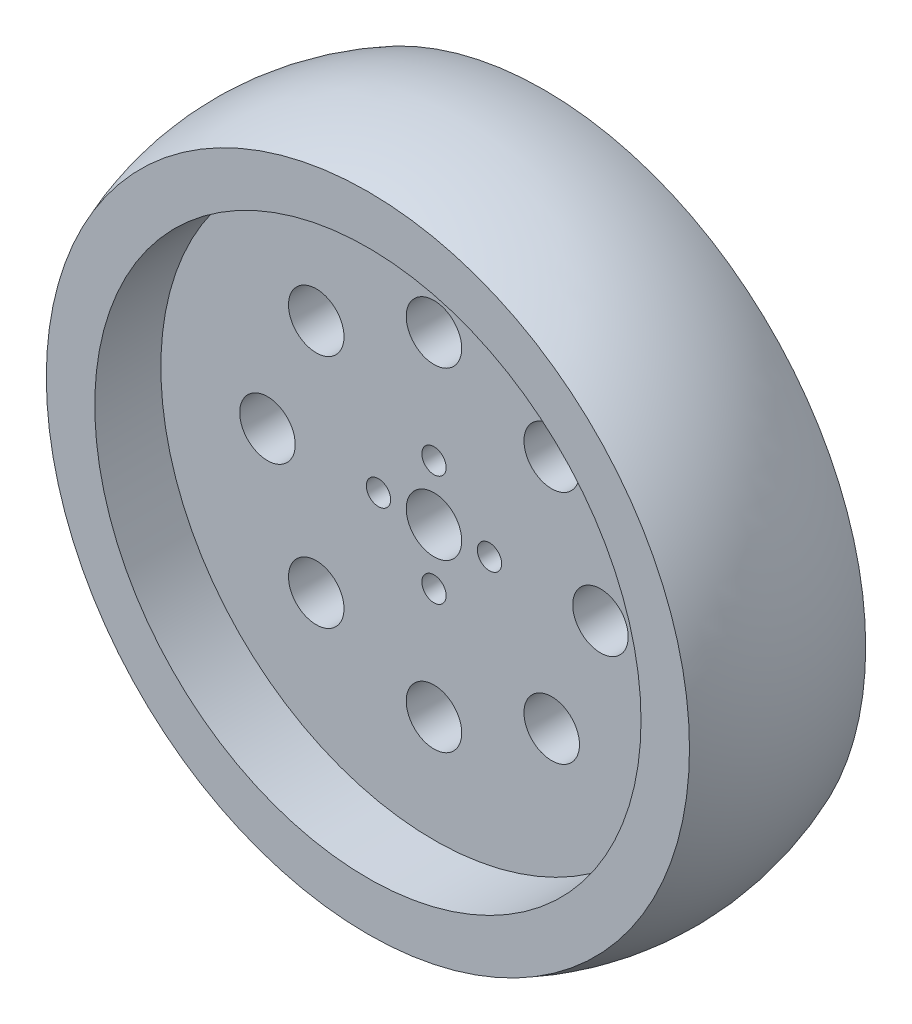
ISO-10303-21;
HEADER;
FILE_DESCRIPTION(('STEP AP214'),'2;1');
FILE_NAME('part.step','',(''),(''),'','','');
FILE_SCHEMA(('AUTOMOTIVE_DESIGN { 1 0 10303 214 1 1 1 1 }'));
ENDSEC;
DATA;
#1=APPLICATION_CONTEXT('core data for automotive mechanical design processes');
#2=APPLICATION_PROTOCOL_DEFINITION('international standard','automotive_design',2000,#1);
#3=PRODUCT_CONTEXT('',#1,'mechanical');
#4=PRODUCT('Part','Part','',(#3));
#5=PRODUCT_RELATED_PRODUCT_CATEGORY('part','',(#4));
#6=PRODUCT_DEFINITION_FORMATION('','',#4);
#7=PRODUCT_DEFINITION_CONTEXT('part definition',#1,'design');
#8=PRODUCT_DEFINITION('design','',#6,#7);
#9=PRODUCT_DEFINITION_SHAPE('','',#8);
#10=(LENGTH_UNIT() NAMED_UNIT(*) SI_UNIT(.MILLI.,.METRE.));
#11=(NAMED_UNIT(*) PLANE_ANGLE_UNIT() SI_UNIT($,.RADIAN.));
#12=(NAMED_UNIT(*) SI_UNIT($,.STERADIAN.) SOLID_ANGLE_UNIT());
#13=UNCERTAINTY_MEASURE_WITH_UNIT(LENGTH_MEASURE(1.E-05),#10,'distance_accuracy_value','');
#14=(GEOMETRIC_REPRESENTATION_CONTEXT(3) GLOBAL_UNCERTAINTY_ASSIGNED_CONTEXT((#13)) GLOBAL_UNIT_ASSIGNED_CONTEXT((#10,
#11,#12)) REPRESENTATION_CONTEXT('',''));
#15=CARTESIAN_POINT('',(0.,0.,0.));
#16=DIRECTION('',(0.,0.,1.));
#17=DIRECTION('',(1.,0.,0.));
#18=AXIS2_PLACEMENT_3D('',#15,#16,#17);
#19=CARTESIAN_POINT('',(0.,0.,2.159));
#20=DIRECTION('',(0.,0.,1.));
#21=DIRECTION('',(1.,0.,0.));
#22=AXIS2_PLACEMENT_3D('',#19,#20,#21);
#23=PLANE('',#22);
#24=CARTESIAN_POINT('',(0.,0.,2.159));
#25=DIRECTION('',(0.,0.,1.));
#26=DIRECTION('',(1.,0.,0.));
#27=AXIS2_PLACEMENT_3D('',#24,#25,#26);
#28=CIRCLE('',#27,39.37);
#29=CARTESIAN_POINT('',(39.37,0.,2.159));
#30=VERTEX_POINT('',#29);
#31=EDGE_CURVE('E52',#30,#30,#28,.T.);
#32=ORIENTED_EDGE('',*,*,#31,.F.);
#33=EDGE_LOOP('',(#32));
#34=FACE_BOUND('',#33,.T.);
#35=CARTESIAN_POINT('',(0.,0.,2.159));
#36=DIRECTION('',(0.,0.,-1.));
#37=DIRECTION('',(-1.,0.,0.));
#38=AXIS2_PLACEMENT_3D('',#35,#36,#37);
#39=CIRCLE('',#38,46.355);
#40=CARTESIAN_POINT('',(-46.355,0.,2.159));
#41=VERTEX_POINT('',#40);
#42=EDGE_CURVE('E150',#41,#41,#39,.T.);
#43=ORIENTED_EDGE('',*,*,#42,.F.);
#44=EDGE_LOOP('',(#43));
#45=FACE_BOUND('',#44,.T.);
#46=ADVANCED_FACE('F32',(#34,#45),#23,.T.);
#47=CARTESIAN_POINT('',(0.,0.,-7.366));
#48=DIRECTION('',(0.,0.,1.));
#49=DIRECTION('',(1.,0.,0.));
#50=AXIS2_PLACEMENT_3D('',#47,#48,#49);
#51=PLANE('',#50);
#52=CARTESIAN_POINT('',(-16.9705627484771,16.9705627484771,-7.366));
#53=DIRECTION('',(0.,0.,1.));
#54=DIRECTION('',(1.,0.,0.));
#55=AXIS2_PLACEMENT_3D('',#52,#53,#54);
#56=CIRCLE('',#55,4.);
#57=CARTESIAN_POINT('',(-12.9705627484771,16.9705627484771,-7.366));
#58=VERTEX_POINT('',#57);
#59=EDGE_CURVE('E122',#58,#58,#56,.T.);
#60=ORIENTED_EDGE('',*,*,#59,.F.);
#61=EDGE_LOOP('',(#60));
#62=FACE_BOUND('',#61,.T.);
#63=CARTESIAN_POINT('',(-16.9705627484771,-16.9705627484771,-7.366));
#64=DIRECTION('',(0.,0.,1.));
#65=DIRECTION('',(1.,0.,0.));
#66=AXIS2_PLACEMENT_3D('',#63,#64,#65);
#67=CIRCLE('',#66,4.);
#68=CARTESIAN_POINT('',(-12.9705627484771,-16.9705627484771,-7.366));
#69=VERTEX_POINT('',#68);
#70=EDGE_CURVE('E112',#69,#69,#67,.T.);
#71=ORIENTED_EDGE('',*,*,#70,.F.);
#72=EDGE_LOOP('',(#71));
#73=FACE_BOUND('',#72,.T.);
#74=CARTESIAN_POINT('',(16.9705627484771,-16.9705627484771,-7.366));
#75=DIRECTION('',(0.,0.,1.));
#76=DIRECTION('',(1.,0.,0.));
#77=AXIS2_PLACEMENT_3D('',#74,#75,#76);
#78=CIRCLE('',#77,4.);
#79=CARTESIAN_POINT('',(20.9705627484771,-16.9705627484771,-7.366));
#80=VERTEX_POINT('',#79);
#81=EDGE_CURVE('E109',#80,#80,#78,.T.);
#82=ORIENTED_EDGE('',*,*,#81,.F.);
#83=EDGE_LOOP('',(#82));
#84=FACE_BOUND('',#83,.T.);
#85=CARTESIAN_POINT('',(16.9705627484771,16.9705627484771,-7.366));
#86=DIRECTION('',(0.,0.,1.));
#87=DIRECTION('',(1.,0.,0.));
#88=AXIS2_PLACEMENT_3D('',#85,#86,#87);
#89=CIRCLE('',#88,4.);
#90=CARTESIAN_POINT('',(20.9705627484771,16.9705627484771,-7.366));
#91=VERTEX_POINT('',#90);
#92=EDGE_CURVE('E106',#91,#91,#89,.T.);
#93=ORIENTED_EDGE('',*,*,#92,.F.);
#94=EDGE_LOOP('',(#93));
#95=FACE_BOUND('',#94,.T.);
#96=CARTESIAN_POINT('',(-24.,0.,-7.366));
#97=DIRECTION('',(0.,0.,1.));
#98=DIRECTION('',(1.,0.,0.));
#99=AXIS2_PLACEMENT_3D('',#96,#97,#98);
#100=CIRCLE('',#99,4.);
#101=CARTESIAN_POINT('',(-20.,0.,-7.366));
#102=VERTEX_POINT('',#101);
#103=EDGE_CURVE('E102',#102,#102,#100,.T.);
#104=ORIENTED_EDGE('',*,*,#103,.F.);
#105=EDGE_LOOP('',(#104));
#106=FACE_BOUND('',#105,.T.);
#107=CARTESIAN_POINT('',(0.,-24.,-7.366));
#108=DIRECTION('',(0.,0.,1.));
#109=DIRECTION('',(1.,0.,0.));
#110=AXIS2_PLACEMENT_3D('',#107,#108,#109);
#111=CIRCLE('',#110,4.);
#112=CARTESIAN_POINT('',(4.,-24.,-7.366));
#113=VERTEX_POINT('',#112);
#114=EDGE_CURVE('E98',#113,#113,#111,.T.);
#115=ORIENTED_EDGE('',*,*,#114,.F.);
#116=EDGE_LOOP('',(#115));
#117=FACE_BOUND('',#116,.T.);
#118=CARTESIAN_POINT('',(24.,0.,-7.366));
#119=DIRECTION('',(0.,0.,1.));
#120=DIRECTION('',(1.,0.,0.));
#121=AXIS2_PLACEMENT_3D('',#118,#119,#120);
#122=CIRCLE('',#121,4.00000000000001);
#123=CARTESIAN_POINT('',(28.,0.,-7.366));
#124=VERTEX_POINT('',#123);
#125=EDGE_CURVE('E94',#124,#124,#122,.T.);
#126=ORIENTED_EDGE('',*,*,#125,.F.);
#127=EDGE_LOOP('',(#126));
#128=FACE_BOUND('',#127,.T.);
#129=CARTESIAN_POINT('',(0.,24.,-7.366));
#130=DIRECTION('',(0.,0.,1.));
#131=DIRECTION('',(1.,0.,0.));
#132=AXIS2_PLACEMENT_3D('',#129,#130,#131);
#133=CIRCLE('',#132,4.);
#134=CARTESIAN_POINT('',(4.,24.,-7.366));
#135=VERTEX_POINT('',#134);
#136=EDGE_CURVE('E90',#135,#135,#133,.T.);
#137=ORIENTED_EDGE('',*,*,#136,.F.);
#138=EDGE_LOOP('',(#137));
#139=FACE_BOUND('',#138,.T.);
#140=CARTESIAN_POINT('',(-8.,0.,-7.366));
#141=DIRECTION('',(0.,0.,1.));
#142=DIRECTION('',(1.,0.,0.));
#143=AXIS2_PLACEMENT_3D('',#140,#141,#142);
#144=CIRCLE('',#143,1.75);
#145=CARTESIAN_POINT('',(-6.25,0.,-7.366));
#146=VERTEX_POINT('',#145);
#147=EDGE_CURVE('E86',#146,#146,#144,.T.);
#148=ORIENTED_EDGE('',*,*,#147,.F.);
#149=EDGE_LOOP('',(#148));
#150=FACE_BOUND('',#149,.T.);
#151=CARTESIAN_POINT('',(0.,-8.,-7.366));
#152=DIRECTION('',(0.,0.,1.));
#153=DIRECTION('',(1.,0.,0.));
#154=AXIS2_PLACEMENT_3D('',#151,#152,#153);
#155=CIRCLE('',#154,1.75);
#156=CARTESIAN_POINT('',(1.75,-8.,-7.366));
#157=VERTEX_POINT('',#156);
#158=EDGE_CURVE('E82',#157,#157,#155,.T.);
#159=ORIENTED_EDGE('',*,*,#158,.F.);
#160=EDGE_LOOP('',(#159));
#161=FACE_BOUND('',#160,.T.);
#162=CARTESIAN_POINT('',(8.,0.,-7.366));
#163=DIRECTION('',(0.,0.,1.));
#164=DIRECTION('',(1.,0.,0.));
#165=AXIS2_PLACEMENT_3D('',#162,#163,#164);
#166=CIRCLE('',#165,1.75);
#167=CARTESIAN_POINT('',(9.75,0.,-7.366));
#168=VERTEX_POINT('',#167);
#169=EDGE_CURVE('E78',#168,#168,#166,.T.);
#170=ORIENTED_EDGE('',*,*,#169,.F.);
#171=EDGE_LOOP('',(#170));
#172=FACE_BOUND('',#171,.T.);
#173=CARTESIAN_POINT('',(0.,8.,-7.366));
#174=DIRECTION('',(0.,0.,1.));
#175=DIRECTION('',(1.,0.,0.));
#176=AXIS2_PLACEMENT_3D('',#173,#174,#175);
#177=CIRCLE('',#176,1.75);
#178=CARTESIAN_POINT('',(1.75,8.,-7.366));
#179=VERTEX_POINT('',#178);
#180=EDGE_CURVE('E74',#179,#179,#177,.T.);
#181=ORIENTED_EDGE('',*,*,#180,.F.);
#182=EDGE_LOOP('',(#181));
#183=FACE_BOUND('',#182,.T.);
#184=CARTESIAN_POINT('',(0.,0.,-7.366));
#185=DIRECTION('',(0.,0.,1.));
#186=DIRECTION('',(1.,0.,0.));
#187=AXIS2_PLACEMENT_3D('',#184,#185,#186);
#188=CIRCLE('',#187,4.);
#189=CARTESIAN_POINT('',(4.,0.,-7.366));
#190=VERTEX_POINT('',#189);
#191=EDGE_CURVE('E70',#190,#190,#188,.T.);
#192=ORIENTED_EDGE('',*,*,#191,.F.);
#193=EDGE_LOOP('',(#192));
#194=FACE_BOUND('',#193,.T.);
#195=CARTESIAN_POINT('',(0.,0.,-7.366));
#196=DIRECTION('',(0.,0.,1.));
#197=DIRECTION('',(1.,0.,0.));
#198=AXIS2_PLACEMENT_3D('',#195,#196,#197);
#199=CIRCLE('',#198,39.37);
#200=CARTESIAN_POINT('',(39.37,0.,-7.366));
#201=VERTEX_POINT('',#200);
#202=EDGE_CURVE('E42',#201,#201,#199,.T.);
#203=ORIENTED_EDGE('',*,*,#202,.T.);
#204=EDGE_LOOP('',(#203));
#205=FACE_BOUND('',#204,.T.);
#206=ADVANCED_FACE('F184',(#62,#73,#84,#95,#106,#117,#128,#139,#150,#161,#172,#183,#194,#205),
#51,.T.);
#207=CARTESIAN_POINT('',(0.,0.,-7.366));
#208=DIRECTION('',(0.,0.,1.));
#209=DIRECTION('',(1.,0.,0.));
#210=AXIS2_PLACEMENT_3D('',#207,#208,#209);
#211=CYLINDRICAL_SURFACE('',#210,39.37);
#212=ORIENTED_EDGE('',*,*,#202,.F.);
#213=EDGE_LOOP('',(#212));
#214=FACE_BOUND('',#213,.T.);
#215=ORIENTED_EDGE('',*,*,#31,.T.);
#216=EDGE_LOOP('',(#215));
#217=FACE_BOUND('',#216,.T.);
#218=ADVANCED_FACE('F175',(#214,#217),#211,.F.);
#219=CARTESIAN_POINT('',(0.,0.,-10.541));
#220=DIRECTION('',(0.,0.,-1.));
#221=DIRECTION('',(-1.,0.,0.));
#222=AXIS2_PLACEMENT_3D('',#219,#220,#221);
#223=DEGENERATE_TOROIDAL_SURFACE('',#222,14.5789335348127,34.22,.T.);
#224=CARTESIAN_POINT('',(0.,0.,-23.241));
#225=DIRECTION('',(0.,0.,-1.));
#226=DIRECTION('',(-1.,0.,0.));
#227=AXIS2_PLACEMENT_3D('',#224,#225,#226);
#228=CIRCLE('',#227,46.355);
#229=CARTESIAN_POINT('',(-46.355,0.,-23.241));
#230=VERTEX_POINT('',#229);
#231=EDGE_CURVE('E69',#230,#230,#228,.T.);
#232=ORIENTED_EDGE('',*,*,#231,.F.);
#233=EDGE_LOOP('',(#232));
#234=FACE_BOUND('',#233,.T.);
#235=ORIENTED_EDGE('',*,*,#42,.T.);
#236=EDGE_LOOP('',(#235));
#237=FACE_BOUND('',#236,.T.);
#238=ADVANCED_FACE('F171',(#234,#237),#223,.T.);
#239=CARTESIAN_POINT('',(0.,0.,-13.716));
#240=DIRECTION('',(0.,0.,-1.));
#241=DIRECTION('',(-1.,0.,0.));
#242=AXIS2_PLACEMENT_3D('',#239,#240,#241);
#243=PLANE('',#242);
#244=CARTESIAN_POINT('',(-16.9705627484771,16.9705627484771,-13.716));
#245=DIRECTION('',(0.,0.,-1.));
#246=DIRECTION('',(-1.,0.,0.));
#247=AXIS2_PLACEMENT_3D('',#244,#245,#246);
#248=CIRCLE('',#247,4.);
#249=CARTESIAN_POINT('',(-20.9705627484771,16.9705627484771,-13.716));
#250=VERTEX_POINT('',#249);
#251=EDGE_CURVE('E37',#250,#250,#248,.T.);
#252=ORIENTED_EDGE('',*,*,#251,.F.);
#253=EDGE_LOOP('',(#252));
#254=FACE_BOUND('',#253,.T.);
#255=CARTESIAN_POINT('',(-16.9705627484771,-16.9705627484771,-13.716));
#256=DIRECTION('',(0.,0.,-1.));
#257=DIRECTION('',(-1.,0.,0.));
#258=AXIS2_PLACEMENT_3D('',#255,#256,#257);
#259=CIRCLE('',#258,4.);
#260=CARTESIAN_POINT('',(-20.9705627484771,-16.9705627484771,-13.716));
#261=VERTEX_POINT('',#260);
#262=EDGE_CURVE('E110',#261,#261,#259,.T.);
#263=ORIENTED_EDGE('',*,*,#262,.F.);
#264=EDGE_LOOP('',(#263));
#265=FACE_BOUND('',#264,.T.);
#266=CARTESIAN_POINT('',(16.9705627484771,-16.9705627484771,-13.716));
#267=DIRECTION('',(0.,0.,-1.));
#268=DIRECTION('',(-1.,0.,0.));
#269=AXIS2_PLACEMENT_3D('',#266,#267,#268);
#270=CIRCLE('',#269,4.);
#271=CARTESIAN_POINT('',(12.9705627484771,-16.9705627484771,-13.716));
#272=VERTEX_POINT('',#271);
#273=EDGE_CURVE('E107',#272,#272,#270,.T.);
#274=ORIENTED_EDGE('',*,*,#273,.F.);
#275=EDGE_LOOP('',(#274));
#276=FACE_BOUND('',#275,.T.);
#277=CARTESIAN_POINT('',(16.9705627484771,16.9705627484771,-13.716));
#278=DIRECTION('',(0.,0.,-1.));
#279=DIRECTION('',(-1.,0.,0.));
#280=AXIS2_PLACEMENT_3D('',#277,#278,#279);
#281=CIRCLE('',#280,4.);
#282=CARTESIAN_POINT('',(12.9705627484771,16.9705627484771,-13.716));
#283=VERTEX_POINT('',#282);
#284=EDGE_CURVE('E103',#283,#283,#281,.T.);
#285=ORIENTED_EDGE('',*,*,#284,.F.);
#286=EDGE_LOOP('',(#285));
#287=FACE_BOUND('',#286,.T.);
#288=CARTESIAN_POINT('',(-24.,0.,-13.716));
#289=DIRECTION('',(0.,0.,-1.));
#290=DIRECTION('',(-1.,0.,0.));
#291=AXIS2_PLACEMENT_3D('',#288,#289,#290);
#292=CIRCLE('',#291,4.);
#293=CARTESIAN_POINT('',(-28.,0.,-13.716));
#294=VERTEX_POINT('',#293);
#295=EDGE_CURVE('E99',#294,#294,#292,.T.);
#296=ORIENTED_EDGE('',*,*,#295,.F.);
#297=EDGE_LOOP('',(#296));
#298=FACE_BOUND('',#297,.T.);
#299=CARTESIAN_POINT('',(0.,-24.,-13.716));
#300=DIRECTION('',(0.,0.,-1.));
#301=DIRECTION('',(-1.,0.,0.));
#302=AXIS2_PLACEMENT_3D('',#299,#300,#301);
#303=CIRCLE('',#302,4.);
#304=CARTESIAN_POINT('',(-4.,-24.,-13.716));
#305=VERTEX_POINT('',#304);
#306=EDGE_CURVE('E95',#305,#305,#303,.T.);
#307=ORIENTED_EDGE('',*,*,#306,.F.);
#308=EDGE_LOOP('',(#307));
#309=FACE_BOUND('',#308,.T.);
#310=CARTESIAN_POINT('',(24.,0.,-13.716));
#311=DIRECTION('',(0.,0.,-1.));
#312=DIRECTION('',(-1.,0.,0.));
#313=AXIS2_PLACEMENT_3D('',#310,#311,#312);
#314=CIRCLE('',#313,4.00000000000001);
#315=CARTESIAN_POINT('',(20.,0.,-13.716));
#316=VERTEX_POINT('',#315);
#317=EDGE_CURVE('E91',#316,#316,#314,.T.);
#318=ORIENTED_EDGE('',*,*,#317,.F.);
#319=EDGE_LOOP('',(#318));
#320=FACE_BOUND('',#319,.T.);
#321=CARTESIAN_POINT('',(0.,24.,-13.716));
#322=DIRECTION('',(0.,0.,-1.));
#323=DIRECTION('',(-1.,0.,0.));
#324=AXIS2_PLACEMENT_3D('',#321,#322,#323);
#325=CIRCLE('',#324,4.);
#326=CARTESIAN_POINT('',(-4.,24.,-13.716));
#327=VERTEX_POINT('',#326);
#328=EDGE_CURVE('E87',#327,#327,#325,.T.);
#329=ORIENTED_EDGE('',*,*,#328,.F.);
#330=EDGE_LOOP('',(#329));
#331=FACE_BOUND('',#330,.T.);
#332=CARTESIAN_POINT('',(-8.,0.,-13.716));
#333=DIRECTION('',(0.,0.,-1.));
#334=DIRECTION('',(-1.,0.,0.));
#335=AXIS2_PLACEMENT_3D('',#332,#333,#334);
#336=CIRCLE('',#335,1.75);
#337=CARTESIAN_POINT('',(-9.75,0.,-13.716));
#338=VERTEX_POINT('',#337);
#339=EDGE_CURVE('E83',#338,#338,#336,.T.);
#340=ORIENTED_EDGE('',*,*,#339,.F.);
#341=EDGE_LOOP('',(#340));
#342=FACE_BOUND('',#341,.T.);
#343=CARTESIAN_POINT('',(0.,-8.,-13.716));
#344=DIRECTION('',(0.,0.,-1.));
#345=DIRECTION('',(-1.,0.,0.));
#346=AXIS2_PLACEMENT_3D('',#343,#344,#345);
#347=CIRCLE('',#346,1.75);
#348=CARTESIAN_POINT('',(-1.75,-8.,-13.716));
#349=VERTEX_POINT('',#348);
#350=EDGE_CURVE('E79',#349,#349,#347,.T.);
#351=ORIENTED_EDGE('',*,*,#350,.F.);
#352=EDGE_LOOP('',(#351));
#353=FACE_BOUND('',#352,.T.);
#354=CARTESIAN_POINT('',(8.,0.,-13.716));
#355=DIRECTION('',(0.,0.,-1.));
#356=DIRECTION('',(-1.,0.,0.));
#357=AXIS2_PLACEMENT_3D('',#354,#355,#356);
#358=CIRCLE('',#357,1.75);
#359=CARTESIAN_POINT('',(6.25,0.,-13.716));
#360=VERTEX_POINT('',#359);
#361=EDGE_CURVE('E75',#360,#360,#358,.T.);
#362=ORIENTED_EDGE('',*,*,#361,.F.);
#363=EDGE_LOOP('',(#362));
#364=FACE_BOUND('',#363,.T.);
#365=CARTESIAN_POINT('',(0.,8.,-13.716));
#366=DIRECTION('',(0.,0.,-1.));
#367=DIRECTION('',(-1.,0.,0.));
#368=AXIS2_PLACEMENT_3D('',#365,#366,#367);
#369=CIRCLE('',#368,1.75);
#370=CARTESIAN_POINT('',(-1.75,8.,-13.716));
#371=VERTEX_POINT('',#370);
#372=EDGE_CURVE('E71',#371,#371,#369,.T.);
#373=ORIENTED_EDGE('',*,*,#372,.F.);
#374=EDGE_LOOP('',(#373));
#375=FACE_BOUND('',#374,.T.);
#376=CARTESIAN_POINT('',(0.,0.,-13.716));
#377=DIRECTION('',(0.,0.,-1.));
#378=DIRECTION('',(-1.,0.,0.));
#379=AXIS2_PLACEMENT_3D('',#376,#377,#378);
#380=CIRCLE('',#379,4.);
#381=CARTESIAN_POINT('',(-4.,0.,-13.716));
#382=VERTEX_POINT('',#381);
#383=EDGE_CURVE('E61',#382,#382,#380,.T.);
#384=ORIENTED_EDGE('',*,*,#383,.F.);
#385=EDGE_LOOP('',(#384));
#386=FACE_BOUND('',#385,.T.);
#387=CARTESIAN_POINT('',(0.,0.,-13.716));
#388=DIRECTION('',(0.,0.,-1.));
#389=DIRECTION('',(-1.,0.,0.));
#390=AXIS2_PLACEMENT_3D('',#387,#388,#389);
#391=CIRCLE('',#390,39.37);
#392=CARTESIAN_POINT('',(-39.37,0.,-13.716));
#393=VERTEX_POINT('',#392);
#394=EDGE_CURVE('E47',#393,#393,#391,.T.);
#395=ORIENTED_EDGE('',*,*,#394,.T.);
#396=EDGE_LOOP('',(#395));
#397=FACE_BOUND('',#396,.T.);
#398=ADVANCED_FACE('F174',(#254,#265,#276,#287,#298,#309,#320,#331,#342,#353,#364,#375,#386,
#397),#243,.T.);
#399=CARTESIAN_POINT('',(0.,0.,-13.716));
#400=DIRECTION('',(0.,0.,-1.));
#401=DIRECTION('',(-1.,0.,0.));
#402=AXIS2_PLACEMENT_3D('',#399,#400,#401);
#403=CYLINDRICAL_SURFACE('',#402,39.37);
#404=ORIENTED_EDGE('',*,*,#394,.F.);
#405=EDGE_LOOP('',(#404));
#406=FACE_BOUND('',#405,.T.);
#407=CARTESIAN_POINT('',(0.,0.,-23.241));
#408=DIRECTION('',(0.,0.,-1.));
#409=DIRECTION('',(-1.,0.,0.));
#410=AXIS2_PLACEMENT_3D('',#407,#408,#409);
#411=CIRCLE('',#410,39.37);
#412=CARTESIAN_POINT('',(-39.37,0.,-23.241));
#413=VERTEX_POINT('',#412);
#414=EDGE_CURVE('E152',#413,#413,#411,.T.);
#415=ORIENTED_EDGE('',*,*,#414,.T.);
#416=EDGE_LOOP('',(#415));
#417=FACE_BOUND('',#416,.T.);
#418=ADVANCED_FACE('F180',(#406,#417),#403,.F.);
#419=CARTESIAN_POINT('',(0.,0.,-23.241));
#420=DIRECTION('',(0.,0.,-1.));
#421=DIRECTION('',(-1.,0.,0.));
#422=AXIS2_PLACEMENT_3D('',#419,#420,#421);
#423=PLANE('',#422);
#424=ORIENTED_EDGE('',*,*,#414,.F.);
#425=EDGE_LOOP('',(#424));
#426=FACE_BOUND('',#425,.T.);
#427=ORIENTED_EDGE('',*,*,#231,.T.);
#428=EDGE_LOOP('',(#427));
#429=FACE_BOUND('',#428,.T.);
#430=ADVANCED_FACE('F177',(#426,#429),#423,.T.);
#431=CARTESIAN_POINT('',(0.,0.,-23.241));
#432=DIRECTION('',(0.,0.,1.));
#433=DIRECTION('',(1.,0.,0.));
#434=AXIS2_PLACEMENT_3D('',#431,#432,#433);
#435=CYLINDRICAL_SURFACE('',#434,4.);
#436=ORIENTED_EDGE('',*,*,#383,.T.);
#437=EDGE_LOOP('',(#436));
#438=FACE_BOUND('',#437,.T.);
#439=ORIENTED_EDGE('',*,*,#191,.T.);
#440=EDGE_LOOP('',(#439));
#441=FACE_BOUND('',#440,.T.);
#442=ADVANCED_FACE('F169',(#438,#441),#435,.F.);
#443=CARTESIAN_POINT('',(0.,8.,-23.241));
#444=DIRECTION('',(0.,0.,1.));
#445=DIRECTION('',(1.,0.,0.));
#446=AXIS2_PLACEMENT_3D('',#443,#444,#445);
#447=CYLINDRICAL_SURFACE('',#446,1.75);
#448=ORIENTED_EDGE('',*,*,#372,.T.);
#449=EDGE_LOOP('',(#448));
#450=FACE_BOUND('',#449,.T.);
#451=ORIENTED_EDGE('',*,*,#180,.T.);
#452=EDGE_LOOP('',(#451));
#453=FACE_BOUND('',#452,.T.);
#454=ADVANCED_FACE('F236',(#450,#453),#447,.F.);
#455=CARTESIAN_POINT('',(8.,0.,-23.241));
#456=DIRECTION('',(0.,0.,1.));
#457=DIRECTION('',(1.,0.,0.));
#458=AXIS2_PLACEMENT_3D('',#455,#456,#457);
#459=CYLINDRICAL_SURFACE('',#458,1.75);
#460=ORIENTED_EDGE('',*,*,#361,.T.);
#461=EDGE_LOOP('',(#460));
#462=FACE_BOUND('',#461,.T.);
#463=ORIENTED_EDGE('',*,*,#169,.T.);
#464=EDGE_LOOP('',(#463));
#465=FACE_BOUND('',#464,.T.);
#466=ADVANCED_FACE('F244',(#462,#465),#459,.F.);
#467=CARTESIAN_POINT('',(0.,-8.,-23.241));
#468=DIRECTION('',(0.,0.,1.));
#469=DIRECTION('',(1.,0.,0.));
#470=AXIS2_PLACEMENT_3D('',#467,#468,#469);
#471=CYLINDRICAL_SURFACE('',#470,1.75);
#472=ORIENTED_EDGE('',*,*,#350,.T.);
#473=EDGE_LOOP('',(#472));
#474=FACE_BOUND('',#473,.T.);
#475=ORIENTED_EDGE('',*,*,#158,.T.);
#476=EDGE_LOOP('',(#475));
#477=FACE_BOUND('',#476,.T.);
#478=ADVANCED_FACE('F251',(#474,#477),#471,.F.);
#479=CARTESIAN_POINT('',(-8.,0.,-23.241));
#480=DIRECTION('',(0.,0.,1.));
#481=DIRECTION('',(1.,0.,0.));
#482=AXIS2_PLACEMENT_3D('',#479,#480,#481);
#483=CYLINDRICAL_SURFACE('',#482,1.75);
#484=ORIENTED_EDGE('',*,*,#339,.T.);
#485=EDGE_LOOP('',(#484));
#486=FACE_BOUND('',#485,.T.);
#487=ORIENTED_EDGE('',*,*,#147,.T.);
#488=EDGE_LOOP('',(#487));
#489=FACE_BOUND('',#488,.T.);
#490=ADVANCED_FACE('F259',(#486,#489),#483,.F.);
#491=CARTESIAN_POINT('',(0.,24.,-23.241));
#492=DIRECTION('',(0.,0.,1.));
#493=DIRECTION('',(1.,0.,0.));
#494=AXIS2_PLACEMENT_3D('',#491,#492,#493);
#495=CYLINDRICAL_SURFACE('',#494,4.);
#496=ORIENTED_EDGE('',*,*,#328,.T.);
#497=EDGE_LOOP('',(#496));
#498=FACE_BOUND('',#497,.T.);
#499=ORIENTED_EDGE('',*,*,#136,.T.);
#500=EDGE_LOOP('',(#499));
#501=FACE_BOUND('',#500,.T.);
#502=ADVANCED_FACE('F267',(#498,#501),#495,.F.);
#503=CARTESIAN_POINT('',(24.,0.,-23.241));
#504=DIRECTION('',(0.,0.,1.));
#505=DIRECTION('',(1.,0.,0.));
#506=AXIS2_PLACEMENT_3D('',#503,#504,#505);
#507=CYLINDRICAL_SURFACE('',#506,4.00000000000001);
#508=ORIENTED_EDGE('',*,*,#317,.T.);
#509=EDGE_LOOP('',(#508));
#510=FACE_BOUND('',#509,.T.);
#511=ORIENTED_EDGE('',*,*,#125,.T.);
#512=EDGE_LOOP('',(#511));
#513=FACE_BOUND('',#512,.T.);
#514=ADVANCED_FACE('F274',(#510,#513),#507,.F.);
#515=CARTESIAN_POINT('',(0.,-24.,-23.241));
#516=DIRECTION('',(0.,0.,1.));
#517=DIRECTION('',(1.,0.,0.));
#518=AXIS2_PLACEMENT_3D('',#515,#516,#517);
#519=CYLINDRICAL_SURFACE('',#518,4.);
#520=ORIENTED_EDGE('',*,*,#306,.T.);
#521=EDGE_LOOP('',(#520));
#522=FACE_BOUND('',#521,.T.);
#523=ORIENTED_EDGE('',*,*,#114,.T.);
#524=EDGE_LOOP('',(#523));
#525=FACE_BOUND('',#524,.T.);
#526=ADVANCED_FACE('F282',(#522,#525),#519,.F.);
#527=CARTESIAN_POINT('',(-24.,0.,-23.241));
#528=DIRECTION('',(0.,0.,1.));
#529=DIRECTION('',(1.,0.,0.));
#530=AXIS2_PLACEMENT_3D('',#527,#528,#529);
#531=CYLINDRICAL_SURFACE('',#530,4.);
#532=ORIENTED_EDGE('',*,*,#295,.T.);
#533=EDGE_LOOP('',(#532));
#534=FACE_BOUND('',#533,.T.);
#535=ORIENTED_EDGE('',*,*,#103,.T.);
#536=EDGE_LOOP('',(#535));
#537=FACE_BOUND('',#536,.T.);
#538=ADVANCED_FACE('F290',(#534,#537),#531,.F.);
#539=CARTESIAN_POINT('',(16.9705627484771,16.9705627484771,-23.241));
#540=DIRECTION('',(0.,0.,1.));
#541=DIRECTION('',(1.,0.,0.));
#542=AXIS2_PLACEMENT_3D('',#539,#540,#541);
#543=CYLINDRICAL_SURFACE('',#542,4.);
#544=ORIENTED_EDGE('',*,*,#284,.T.);
#545=EDGE_LOOP('',(#544));
#546=FACE_BOUND('',#545,.T.);
#547=ORIENTED_EDGE('',*,*,#92,.T.);
#548=EDGE_LOOP('',(#547));
#549=FACE_BOUND('',#548,.T.);
#550=ADVANCED_FACE('F298',(#546,#549),#543,.F.);
#551=CARTESIAN_POINT('',(16.9705627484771,-16.9705627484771,-23.241));
#552=DIRECTION('',(0.,0.,1.));
#553=DIRECTION('',(1.,0.,0.));
#554=AXIS2_PLACEMENT_3D('',#551,#552,#553);
#555=CYLINDRICAL_SURFACE('',#554,4.);
#556=ORIENTED_EDGE('',*,*,#273,.T.);
#557=EDGE_LOOP('',(#556));
#558=FACE_BOUND('',#557,.T.);
#559=ORIENTED_EDGE('',*,*,#81,.T.);
#560=EDGE_LOOP('',(#559));
#561=FACE_BOUND('',#560,.T.);
#562=ADVANCED_FACE('F306',(#558,#561),#555,.F.);
#563=CARTESIAN_POINT('',(-16.9705627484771,-16.9705627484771,-23.241));
#564=DIRECTION('',(0.,0.,1.));
#565=DIRECTION('',(1.,0.,0.));
#566=AXIS2_PLACEMENT_3D('',#563,#564,#565);
#567=CYLINDRICAL_SURFACE('',#566,4.);
#568=ORIENTED_EDGE('',*,*,#262,.T.);
#569=EDGE_LOOP('',(#568));
#570=FACE_BOUND('',#569,.T.);
#571=ORIENTED_EDGE('',*,*,#70,.T.);
#572=EDGE_LOOP('',(#571));
#573=FACE_BOUND('',#572,.T.);
#574=ADVANCED_FACE('F314',(#570,#573),#567,.F.);
#575=CARTESIAN_POINT('',(-16.9705627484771,16.9705627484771,-23.241));
#576=DIRECTION('',(0.,0.,1.));
#577=DIRECTION('',(1.,0.,0.));
#578=AXIS2_PLACEMENT_3D('',#575,#576,#577);
#579=CYLINDRICAL_SURFACE('',#578,4.);
#580=ORIENTED_EDGE('',*,*,#251,.T.);
#581=EDGE_LOOP('',(#580));
#582=FACE_BOUND('',#581,.T.);
#583=ORIENTED_EDGE('',*,*,#59,.T.);
#584=EDGE_LOOP('',(#583));
#585=FACE_BOUND('',#584,.T.);
#586=ADVANCED_FACE('F322',(#582,#585),#579,.F.);
#587=CLOSED_SHELL('',(#46,#206,#218,#238,#398,#418,#430,#442,#454,#466,#478,#490,#502,#514,#526,
#538,#550,#562,#574,#586));
#588=CARTESIAN_POINT('',(0.,0.,-21.082));
#589=DIRECTION('',(0.,0.,1.));
#590=DIRECTION('',(1.,0.,0.));
#591=AXIS2_PLACEMENT_3D('',#588,#589,#590);
#592=CYLINDRICAL_SURFACE('',#591,44.45);
#593=CARTESIAN_POINT('',(0.,0.,-21.082));
#594=DIRECTION('',(0.,0.,-1.));
#595=DIRECTION('',(-1.,0.,0.));
#596=AXIS2_PLACEMENT_3D('',#593,#594,#595);
#597=CIRCLE('',#596,44.45);
#598=CARTESIAN_POINT('',(-44.45,0.,-21.082));
#599=VERTEX_POINT('',#598);
#600=EDGE_CURVE('E147',#599,#599,#597,.T.);
#601=ORIENTED_EDGE('',*,*,#600,.F.);
#602=EDGE_LOOP('',(#601));
#603=FACE_BOUND('',#602,.T.);
#604=CARTESIAN_POINT('',(0.,0.,0.));
#605=DIRECTION('',(0.,0.,1.));
#606=DIRECTION('',(-1.,0.,0.));
#607=AXIS2_PLACEMENT_3D('',#604,#605,#606);
#608=CIRCLE('',#607,44.4547996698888);
#609=CARTESIAN_POINT('',(-44.4547996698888,0.,0.));
#610=VERTEX_POINT('',#609);
#611=EDGE_CURVE('E10',#610,#610,#608,.T.);
#612=ORIENTED_EDGE('',*,*,#611,.F.);
#613=EDGE_LOOP('',(#612));
#614=FACE_BOUND('',#613,.T.);
#615=ADVANCED_FACE('F34',(#603,#614),#592,.T.);
#616=CARTESIAN_POINT('',(0.,0.,-21.082));
#617=DIRECTION('',(0.,0.,1.));
#618=DIRECTION('',(1.,0.,0.));
#619=AXIS2_PLACEMENT_3D('',#616,#617,#618);
#620=CONICAL_SURFACE('',#619,44.45,0.00022766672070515);
#621=ORIENTED_EDGE('',*,*,#611,.T.);
#622=EDGE_LOOP('',(#621));
#623=FACE_BOUND('',#622,.T.);
#624=ORIENTED_EDGE('',*,*,#600,.T.);
#625=EDGE_LOOP('',(#624));
#626=FACE_BOUND('',#625,.T.);
#627=ADVANCED_FACE('F158',(#623,#626),#620,.F.);
#628=CLOSED_SHELL('',(#615,#627));
#629=ORIENTED_CLOSED_SHELL('',*,#628,.T.);
#630=BREP_WITH_VOIDS('B2',#587,(#629));
#631=ADVANCED_BREP_SHAPE_REPRESENTATION('',(#18,#630),#14);
#632=SHAPE_DEFINITION_REPRESENTATION(#9,#631);
ENDSEC;
END-ISO-10303-21;
